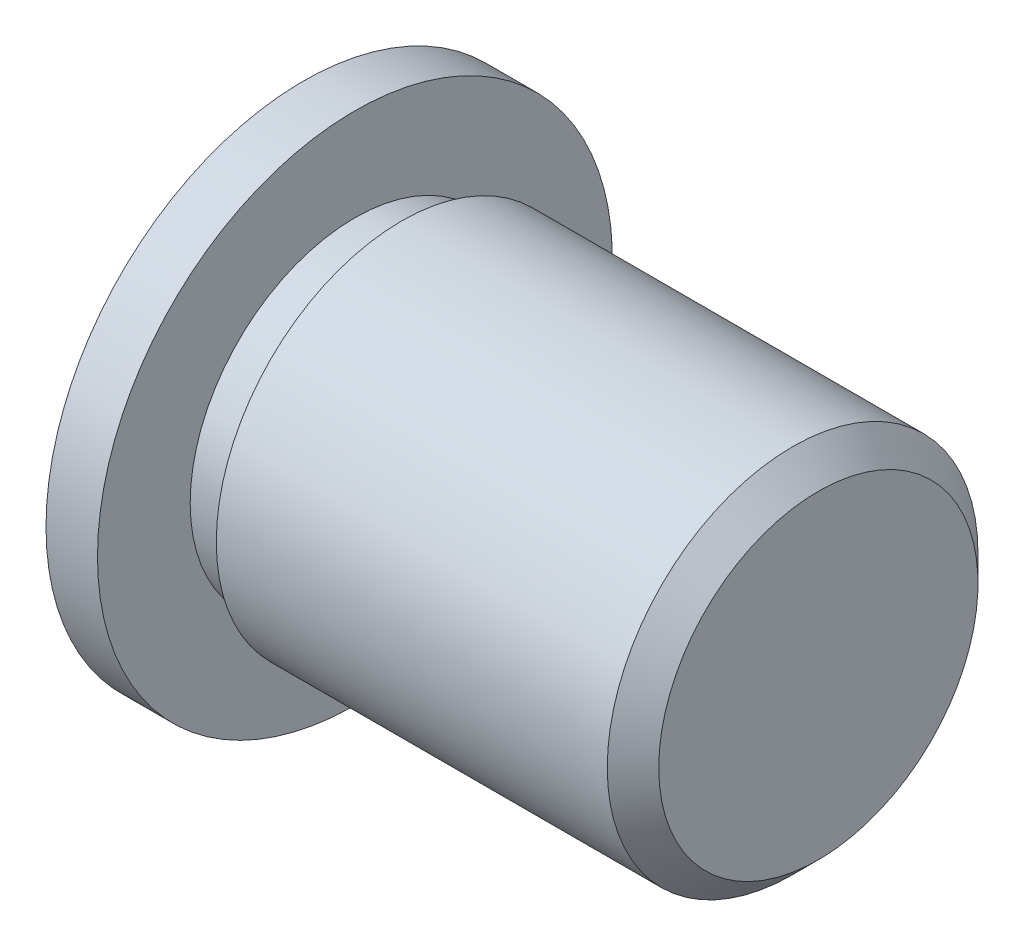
ISO-10303-21;
HEADER;
FILE_DESCRIPTION(('STEP AP214'),'2;1');
FILE_NAME('part.step','',(''),(''),'','','');
FILE_SCHEMA(('AUTOMOTIVE_DESIGN { 1 0 10303 214 1 1 1 1 }'));
ENDSEC;
DATA;
#1=APPLICATION_CONTEXT('core data for automotive mechanical design processes');
#2=APPLICATION_PROTOCOL_DEFINITION('international standard','automotive_design',2000,#1);
#3=PRODUCT_CONTEXT('',#1,'mechanical');
#4=PRODUCT('Part','Part','',(#3));
#5=PRODUCT_RELATED_PRODUCT_CATEGORY('part','',(#4));
#6=PRODUCT_DEFINITION_FORMATION('','',#4);
#7=PRODUCT_DEFINITION_CONTEXT('part definition',#1,'design');
#8=PRODUCT_DEFINITION('design','',#6,#7);
#9=PRODUCT_DEFINITION_SHAPE('','',#8);
#10=(LENGTH_UNIT() NAMED_UNIT(*) SI_UNIT(.MILLI.,.METRE.));
#11=(NAMED_UNIT(*) PLANE_ANGLE_UNIT() SI_UNIT($,.RADIAN.));
#12=(NAMED_UNIT(*) SI_UNIT($,.STERADIAN.) SOLID_ANGLE_UNIT());
#13=UNCERTAINTY_MEASURE_WITH_UNIT(LENGTH_MEASURE(1.E-05),#10,'distance_accuracy_value','');
#14=(GEOMETRIC_REPRESENTATION_CONTEXT(3) GLOBAL_UNCERTAINTY_ASSIGNED_CONTEXT((#13)) GLOBAL_UNIT_ASSIGNED_CONTEXT((#10,
#11,#12)) REPRESENTATION_CONTEXT('',''));
#15=CARTESIAN_POINT('',(0.,0.,0.));
#16=DIRECTION('',(0.,0.,1.));
#17=DIRECTION('',(1.,0.,0.));
#18=AXIS2_PLACEMENT_3D('',#15,#16,#17);
#19=CARTESIAN_POINT('',(0.,0.,0.));
#20=DIRECTION('',(1.,0.,0.));
#21=DIRECTION('',(0.,0.,-1.));
#22=AXIS2_PLACEMENT_3D('',#19,#20,#21);
#23=PLANE('',#22);
#24=CARTESIAN_POINT('',(0.,0.,0.));
#25=DIRECTION('',(-1.,0.,0.));
#26=DIRECTION('',(0.,0.,1.));
#27=AXIS2_PLACEMENT_3D('',#24,#25,#26);
#28=CIRCLE('',#27,25.);
#29=CARTESIAN_POINT('',(0.,0.,25.));
#30=VERTEX_POINT('',#29);
#31=EDGE_CURVE('E10',#30,#30,#28,.T.);
#32=ORIENTED_EDGE('',*,*,#31,.T.);
#33=EDGE_LOOP('',(#32));
#34=FACE_BOUND('',#33,.T.);
#35=ADVANCED_FACE('F33',(#34),#23,.F.);
#36=CARTESIAN_POINT('',(0.,0.,0.));
#37=DIRECTION('',(-1.,0.,0.));
#38=DIRECTION('',(0.,0.,1.));
#39=AXIS2_PLACEMENT_3D('',#36,#37,#38);
#40=CYLINDRICAL_SURFACE('',#39,25.);
#41=ORIENTED_EDGE('',*,*,#31,.F.);
#42=EDGE_LOOP('',(#41));
#43=FACE_BOUND('',#42,.T.);
#44=CARTESIAN_POINT('',(5.,0.,0.));
#45=DIRECTION('',(-1.,0.,0.));
#46=DIRECTION('',(0.,0.,1.));
#47=AXIS2_PLACEMENT_3D('',#44,#45,#46);
#48=CIRCLE('',#47,25.);
#49=CARTESIAN_POINT('',(5.,0.,25.));
#50=VERTEX_POINT('',#49);
#51=EDGE_CURVE('E39',#50,#50,#48,.T.);
#52=ORIENTED_EDGE('',*,*,#51,.T.);
#53=EDGE_LOOP('',(#52));
#54=FACE_BOUND('',#53,.T.);
#55=ADVANCED_FACE('F74',(#43,#54),#40,.T.);
#56=CARTESIAN_POINT('',(5.,25.,0.));
#57=DIRECTION('',(-1.,0.,0.));
#58=DIRECTION('',(0.,0.,1.));
#59=AXIS2_PLACEMENT_3D('',#56,#57,#58);
#60=PLANE('',#59);
#61=ORIENTED_EDGE('',*,*,#51,.F.);
#62=EDGE_LOOP('',(#61));
#63=FACE_BOUND('',#62,.T.);
#64=CARTESIAN_POINT('',(5.,0.,0.));
#65=DIRECTION('',(-1.,0.,0.));
#66=DIRECTION('',(0.,0.,1.));
#67=AXIS2_PLACEMENT_3D('',#64,#65,#66);
#68=CIRCLE('',#67,16.);
#69=CARTESIAN_POINT('',(5.,0.,16.));
#70=VERTEX_POINT('',#69);
#71=EDGE_CURVE('E43',#70,#70,#68,.T.);
#72=ORIENTED_EDGE('',*,*,#71,.T.);
#73=EDGE_LOOP('',(#72));
#74=FACE_BOUND('',#73,.T.);
#75=ADVANCED_FACE('F78',(#63,#74),#60,.F.);
#76=CARTESIAN_POINT('',(0.,0.,0.));
#77=DIRECTION('',(-1.,0.,0.));
#78=DIRECTION('',(0.,0.,1.));
#79=AXIS2_PLACEMENT_3D('',#76,#77,#78);
#80=CYLINDRICAL_SURFACE('',#79,16.);
#81=ORIENTED_EDGE('',*,*,#71,.F.);
#82=EDGE_LOOP('',(#81));
#83=FACE_BOUND('',#82,.T.);
#84=CARTESIAN_POINT('',(9.,0.,0.));
#85=DIRECTION('',(-1.,0.,0.));
#86=DIRECTION('',(0.,0.,1.));
#87=AXIS2_PLACEMENT_3D('',#84,#85,#86);
#88=CIRCLE('',#87,16.);
#89=CARTESIAN_POINT('',(9.,0.,16.));
#90=VERTEX_POINT('',#89);
#91=EDGE_CURVE('E47',#90,#90,#88,.T.);
#92=ORIENTED_EDGE('',*,*,#91,.T.);
#93=EDGE_LOOP('',(#92));
#94=FACE_BOUND('',#93,.T.);
#95=ADVANCED_FACE('F83',(#83,#94),#80,.T.);
#96=CARTESIAN_POINT('',(9.53589838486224,0.,0.));
#97=DIRECTION('',(1.,0.,0.));
#98=DIRECTION('',(0.,0.,-1.));
#99=AXIS2_PLACEMENT_3D('',#96,#97,#98);
#100=CONICAL_SURFACE('',#99,18.,1.30899693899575);
#101=ORIENTED_EDGE('',*,*,#91,.F.);
#102=EDGE_LOOP('',(#101));
#103=FACE_BOUND('',#102,.T.);
#104=CARTESIAN_POINT('',(9.53589838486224,0.,0.));
#105=DIRECTION('',(-1.,0.,0.));
#106=DIRECTION('',(0.,0.,1.));
#107=AXIS2_PLACEMENT_3D('',#104,#105,#106);
#108=CIRCLE('',#107,18.);
#109=CARTESIAN_POINT('',(9.53589838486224,0.,18.));
#110=VERTEX_POINT('',#109);
#111=EDGE_CURVE('E52',#110,#110,#108,.T.);
#112=ORIENTED_EDGE('',*,*,#111,.T.);
#113=EDGE_LOOP('',(#112));
#114=FACE_BOUND('',#113,.T.);
#115=ADVANCED_FACE('F89',(#103,#114),#100,.T.);
#116=CARTESIAN_POINT('',(0.,0.,0.));
#117=DIRECTION('',(-1.,0.,0.));
#118=DIRECTION('',(0.,0.,1.));
#119=AXIS2_PLACEMENT_3D('',#116,#117,#118);
#120=CYLINDRICAL_SURFACE('',#119,18.);
#121=ORIENTED_EDGE('',*,*,#111,.F.);
#122=EDGE_LOOP('',(#121));
#123=FACE_BOUND('',#122,.T.);
#124=CARTESIAN_POINT('',(47.5,0.,0.));
#125=DIRECTION('',(-1.,0.,0.));
#126=DIRECTION('',(0.,0.,1.));
#127=AXIS2_PLACEMENT_3D('',#124,#125,#126);
#128=CIRCLE('',#127,18.);
#129=CARTESIAN_POINT('',(47.5,0.,18.));
#130=VERTEX_POINT('',#129);
#131=EDGE_CURVE('E55',#130,#130,#128,.T.);
#132=ORIENTED_EDGE('',*,*,#131,.T.);
#133=EDGE_LOOP('',(#132));
#134=FACE_BOUND('',#133,.T.);
#135=ADVANCED_FACE('F70',(#123,#134),#120,.T.);
#136=CARTESIAN_POINT('',(50.,0.,0.));
#137=DIRECTION('',(-1.,0.,0.));
#138=DIRECTION('',(0.,0.,1.));
#139=AXIS2_PLACEMENT_3D('',#136,#137,#138);
#140=CONICAL_SURFACE('',#139,15.5,0.785398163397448);
#141=ORIENTED_EDGE('',*,*,#131,.F.);
#142=EDGE_LOOP('',(#141));
#143=FACE_BOUND('',#142,.T.);
#144=CARTESIAN_POINT('',(50.,0.,0.));
#145=DIRECTION('',(-1.,0.,0.));
#146=DIRECTION('',(0.,0.,1.));
#147=AXIS2_PLACEMENT_3D('',#144,#145,#146);
#148=CIRCLE('',#147,15.5);
#149=CARTESIAN_POINT('',(50.,0.,15.5));
#150=VERTEX_POINT('',#149);
#151=EDGE_CURVE('E58',#150,#150,#148,.T.);
#152=ORIENTED_EDGE('',*,*,#151,.T.);
#153=EDGE_LOOP('',(#152));
#154=FACE_BOUND('',#153,.T.);
#155=ADVANCED_FACE('F62',(#143,#154),#140,.T.);
#156=CARTESIAN_POINT('',(50.,15.5,0.));
#157=DIRECTION('',(-1.,0.,0.));
#158=DIRECTION('',(0.,0.,1.));
#159=AXIS2_PLACEMENT_3D('',#156,#157,#158);
#160=PLANE('',#159);
#161=ORIENTED_EDGE('',*,*,#151,.F.);
#162=EDGE_LOOP('',(#161));
#163=FACE_BOUND('',#162,.T.);
#164=ADVANCED_FACE('F64',(#163),#160,.F.);
#165=CLOSED_SHELL('',(#35,#55,#75,#95,#115,#135,#155,#164));
#166=MANIFOLD_SOLID_BREP('B2',#165);
#167=ADVANCED_BREP_SHAPE_REPRESENTATION('',(#18,#166),#14);
#168=SHAPE_DEFINITION_REPRESENTATION(#9,#167);
ENDSEC;
END-ISO-10303-21;
